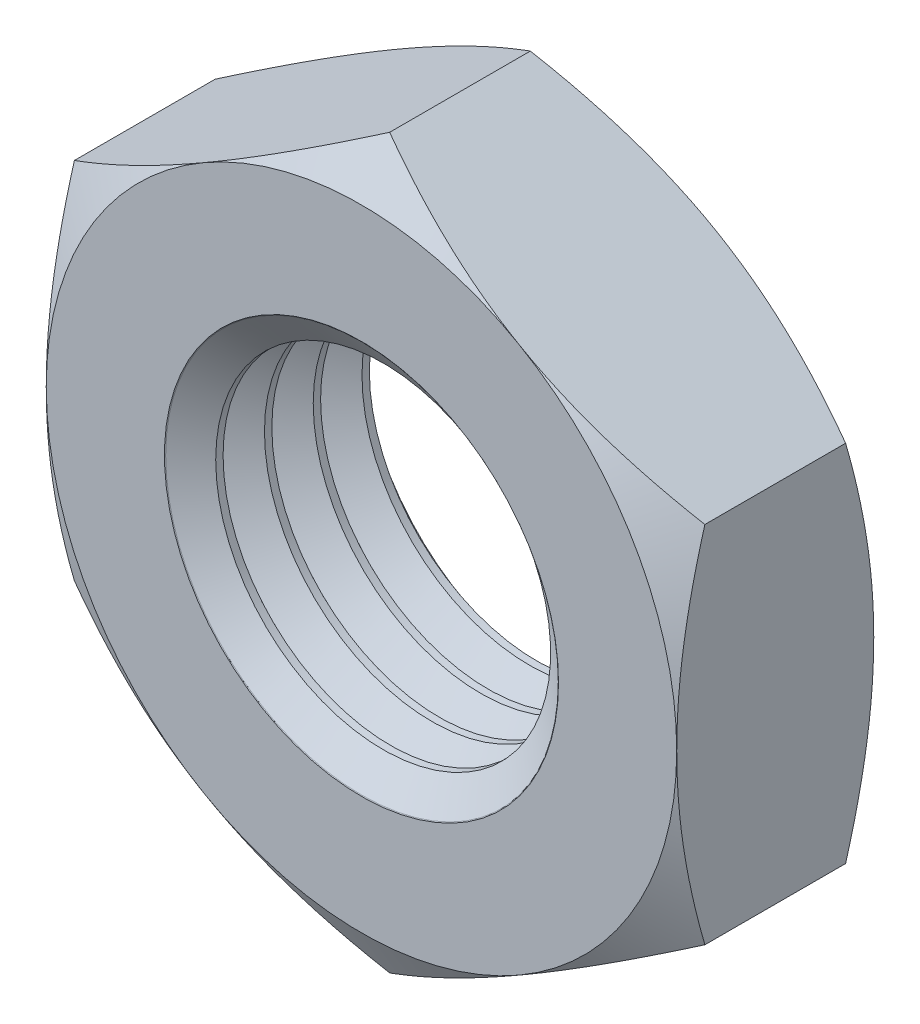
ISO-10303-21;
HEADER;
FILE_DESCRIPTION(('STEP AP214'),'2;1');
FILE_NAME('part.step','',(''),(''),'','','');
FILE_SCHEMA(('AUTOMOTIVE_DESIGN { 1 0 10303 214 1 1 1 1 }'));
ENDSEC;
DATA;
#1=APPLICATION_CONTEXT('core data for automotive mechanical design processes');
#2=APPLICATION_PROTOCOL_DEFINITION('international standard','automotive_design',2000,#1);
#3=PRODUCT_CONTEXT('',#1,'mechanical');
#4=PRODUCT('Part','Part','',(#3));
#5=PRODUCT_RELATED_PRODUCT_CATEGORY('part','',(#4));
#6=PRODUCT_DEFINITION_FORMATION('','',#4);
#7=PRODUCT_DEFINITION_CONTEXT('part definition',#1,'design');
#8=PRODUCT_DEFINITION('design','',#6,#7);
#9=PRODUCT_DEFINITION_SHAPE('','',#8);
#10=(LENGTH_UNIT() NAMED_UNIT(*) SI_UNIT(.MILLI.,.METRE.));
#11=(NAMED_UNIT(*) PLANE_ANGLE_UNIT() SI_UNIT($,.RADIAN.));
#12=(NAMED_UNIT(*) SI_UNIT($,.STERADIAN.) SOLID_ANGLE_UNIT());
#13=UNCERTAINTY_MEASURE_WITH_UNIT(LENGTH_MEASURE(1.E-05),#10,'distance_accuracy_value','');
#14=(GEOMETRIC_REPRESENTATION_CONTEXT(3) GLOBAL_UNCERTAINTY_ASSIGNED_CONTEXT((#13)) GLOBAL_UNIT_ASSIGNED_CONTEXT((#10,
#11,#12)) REPRESENTATION_CONTEXT('',''));
#15=CARTESIAN_POINT('',(0.,0.,0.));
#16=DIRECTION('',(0.,0.,1.));
#17=DIRECTION('',(1.,0.,0.));
#18=AXIS2_PLACEMENT_3D('',#15,#16,#17);
#19=CARTESIAN_POINT('',(0.,0.,-5.));
#20=DIRECTION('',(0.,0.,1.));
#21=DIRECTION('',(1.,0.,0.));
#22=AXIS2_PLACEMENT_3D('',#19,#20,#21);
#23=CYLINDRICAL_SURFACE('',#22,4.25);
#24=CARTESIAN_POINT('',(0.,0.,-4.26245565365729));
#25=DIRECTION('',(0.,0.,-1.));
#26=DIRECTION('',(-1.,0.,0.));
#27=AXIS2_PLACEMENT_3D('',#24,#25,#26);
#28=CIRCLE('',#27,4.25);
#29=CARTESIAN_POINT('',(-4.25,0.,-4.26245565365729));
#30=VERTEX_POINT('',#29);
#31=EDGE_CURVE('E344',#30,#30,#28,.T.);
#32=ORIENTED_EDGE('',*,*,#31,.F.);
#33=EDGE_LOOP('',(#32));
#34=FACE_BOUND('',#33,.T.);
#35=CARTESIAN_POINT('',(0.,0.,-4.44944434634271));
#36=DIRECTION('',(0.,0.,-1.));
#37=DIRECTION('',(-1.,0.,0.));
#38=AXIS2_PLACEMENT_3D('',#35,#36,#37);
#39=CIRCLE('',#38,4.25);
#40=CARTESIAN_POINT('',(-4.25,0.,-4.44944434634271));
#41=VERTEX_POINT('',#40);
#42=EDGE_CURVE('E174',#41,#41,#39,.F.);
#43=ORIENTED_EDGE('',*,*,#42,.F.);
#44=EDGE_LOOP('',(#43));
#45=FACE_BOUND('',#44,.T.);
#46=ADVANCED_FACE('F32',(#34,#45),#23,.F.);
#47=CARTESIAN_POINT('',(0.,0.,-3.21214434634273));
#48=DIRECTION('',(0.,0.,-1.));
#49=DIRECTION('',(-1.,0.,0.));
#50=AXIS2_PLACEMENT_3D('',#47,#48,#49);
#51=CIRCLE('',#50,4.25);
#52=CARTESIAN_POINT('',(-4.25,0.,-3.21214434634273));
#53=VERTEX_POINT('',#52);
#54=EDGE_CURVE('E347',#53,#53,#51,.T.);
#55=ORIENTED_EDGE('',*,*,#54,.T.);
#56=EDGE_LOOP('',(#55));
#57=FACE_BOUND('',#56,.T.);
#58=CARTESIAN_POINT('',(0.,0.,-3.02515565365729));
#59=DIRECTION('',(0.,0.,-1.));
#60=DIRECTION('',(-1.,0.,0.));
#61=AXIS2_PLACEMENT_3D('',#58,#59,#60);
#62=CIRCLE('',#61,4.25);
#63=CARTESIAN_POINT('',(-4.25,0.,-3.02515565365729));
#64=VERTEX_POINT('',#63);
#65=EDGE_CURVE('E335',#64,#64,#62,.T.);
#66=ORIENTED_EDGE('',*,*,#65,.F.);
#67=EDGE_LOOP('',(#66));
#68=FACE_BOUND('',#67,.T.);
#69=ADVANCED_FACE('F294',(#57,#68),#23,.F.);
#70=CARTESIAN_POINT('',(0.,0.,-1.97484434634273));
#71=DIRECTION('',(0.,0.,-1.));
#72=DIRECTION('',(-1.,0.,0.));
#73=AXIS2_PLACEMENT_3D('',#70,#71,#72);
#74=CIRCLE('',#73,4.25);
#75=CARTESIAN_POINT('',(-4.25,0.,-1.97484434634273));
#76=VERTEX_POINT('',#75);
#77=EDGE_CURVE('E338',#76,#76,#74,.T.);
#78=ORIENTED_EDGE('',*,*,#77,.T.);
#79=EDGE_LOOP('',(#78));
#80=FACE_BOUND('',#79,.T.);
#81=CARTESIAN_POINT('',(0.,0.,-1.78785565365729));
#82=DIRECTION('',(0.,0.,-1.));
#83=DIRECTION('',(-1.,0.,0.));
#84=AXIS2_PLACEMENT_3D('',#81,#82,#83);
#85=CIRCLE('',#84,4.25);
#86=CARTESIAN_POINT('',(-4.25,0.,-1.78785565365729));
#87=VERTEX_POINT('',#86);
#88=EDGE_CURVE('E326',#87,#87,#85,.T.);
#89=ORIENTED_EDGE('',*,*,#88,.F.);
#90=EDGE_LOOP('',(#89));
#91=FACE_BOUND('',#90,.T.);
#92=ADVANCED_FACE('F300',(#80,#91),#23,.F.);
#93=CARTESIAN_POINT('',(0.,0.,-0.737544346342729));
#94=DIRECTION('',(0.,0.,-1.));
#95=DIRECTION('',(-1.,0.,0.));
#96=AXIS2_PLACEMENT_3D('',#93,#94,#95);
#97=CIRCLE('',#96,4.25);
#98=CARTESIAN_POINT('',(-4.25,0.,-0.737544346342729));
#99=VERTEX_POINT('',#98);
#100=EDGE_CURVE('E316',#99,#99,#97,.T.);
#101=ORIENTED_EDGE('',*,*,#100,.T.);
#102=EDGE_LOOP('',(#101));
#103=FACE_BOUND('',#102,.T.);
#104=CARTESIAN_POINT('',(0.,0.,-0.550555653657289));
#105=DIRECTION('',(0.,0.,-1.));
#106=DIRECTION('',(-1.,0.,0.));
#107=AXIS2_PLACEMENT_3D('',#104,#105,#106);
#108=CIRCLE('',#107,4.25);
#109=CARTESIAN_POINT('',(-4.25,0.,-0.550555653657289));
#110=VERTEX_POINT('',#109);
#111=EDGE_CURVE('E319',#110,#110,#108,.T.);
#112=ORIENTED_EDGE('',*,*,#111,.F.);
#113=EDGE_LOOP('',(#112));
#114=FACE_BOUND('',#113,.T.);
#115=ADVANCED_FACE('F296',(#103,#114),#23,.F.);
#116=CARTESIAN_POINT('',(0.,9.23760430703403,-5.));
#117=DIRECTION('',(0.,0.,-1.));
#118=DIRECTION('',(-1.,0.,0.));
#119=AXIS2_PLACEMENT_3D('',#116,#117,#118);
#120=PLANE('',#119);
#121=CARTESIAN_POINT('',(0.,0.,-5.));
#122=DIRECTION('',(0.,0.,-1.));
#123=DIRECTION('',(-1.,0.,0.));
#124=AXIS2_PLACEMENT_3D('',#121,#122,#123);
#125=CIRCLE('',#124,8.);
#126=CARTESIAN_POINT('',(-8.,0.,-5.));
#127=VERTEX_POINT('',#126);
#128=CARTESIAN_POINT('',(-4.00000000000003,-6.92820323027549,-5.));
#129=VERTEX_POINT('',#128);
#130=EDGE_CURVE('E168',#127,#129,#125,.F.);
#131=ORIENTED_EDGE('',*,*,#130,.F.);
#132=CARTESIAN_POINT('',(-4.00000000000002,6.9282032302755,-5.));
#133=VERTEX_POINT('',#132);
#134=EDGE_CURVE('E150',#133,#127,#125,.F.);
#135=ORIENTED_EDGE('',*,*,#134,.F.);
#136=CARTESIAN_POINT('',(4.00000000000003,6.92820323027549,-5.));
#137=VERTEX_POINT('',#136);
#138=EDGE_CURVE('E167',#137,#133,#125,.F.);
#139=ORIENTED_EDGE('',*,*,#138,.F.);
#140=CARTESIAN_POINT('',(0.,0.,-5.));
#141=DIRECTION('',(0.,0.,1.));
#142=DIRECTION('',(1.,0.,0.));
#143=AXIS2_PLACEMENT_3D('',#140,#141,#142);
#144=CIRCLE('',#143,8.);
#145=CARTESIAN_POINT('',(8.,0.,-5.));
#146=VERTEX_POINT('',#145);
#147=EDGE_CURVE('E241',#146,#137,#144,.T.);
#148=ORIENTED_EDGE('',*,*,#147,.F.);
#149=CARTESIAN_POINT('',(4.00000000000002,-6.9282032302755,-5.));
#150=VERTEX_POINT('',#149);
#151=EDGE_CURVE('E465',#150,#146,#125,.F.);
#152=ORIENTED_EDGE('',*,*,#151,.F.);
#153=EDGE_CURVE('E486',#129,#150,#125,.F.);
#154=ORIENTED_EDGE('',*,*,#153,.F.);
#155=EDGE_LOOP('',(#131,#135,#139,#148,#152,#154));
#156=FACE_BOUND('',#155,.T.);
#157=CARTESIAN_POINT('',(0.,0.,-5.));
#158=DIRECTION('',(0.,0.,-1.));
#159=DIRECTION('',(-1.,0.,0.));
#160=AXIS2_PLACEMENT_3D('',#157,#158,#159);
#161=CIRCLE('',#160,5.);
#162=CARTESIAN_POINT('',(-5.,0.,-5.));
#163=VERTEX_POINT('',#162);
#164=EDGE_CURVE('E172',#163,#163,#161,.F.);
#165=ORIENTED_EDGE('',*,*,#164,.T.);
#166=EDGE_LOOP('',(#165));
#167=FACE_BOUND('',#166,.T.);
#168=ADVANCED_FACE('F305',(#156,#167),#120,.T.);
#169=CARTESIAN_POINT('',(0.,9.23760430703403,0.));
#170=DIRECTION('',(0.,0.,-1.));
#171=DIRECTION('',(-1.,0.,0.));
#172=AXIS2_PLACEMENT_3D('',#169,#170,#171);
#173=PLANE('',#172);
#174=CARTESIAN_POINT('',(0.,0.,0.));
#175=DIRECTION('',(0.,0.,-1.));
#176=DIRECTION('',(-1.,0.,0.));
#177=AXIS2_PLACEMENT_3D('',#174,#175,#176);
#178=CIRCLE('',#177,8.);
#179=CARTESIAN_POINT('',(-8.,0.,0.));
#180=VERTEX_POINT('',#179);
#181=CARTESIAN_POINT('',(-4.00000000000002,6.9282032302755,0.));
#182=VERTEX_POINT('',#181);
#183=EDGE_CURVE('E11',#180,#182,#178,.T.);
#184=ORIENTED_EDGE('',*,*,#183,.F.);
#185=CARTESIAN_POINT('',(-4.00000000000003,-6.92820323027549,0.));
#186=VERTEX_POINT('',#185);
#187=EDGE_CURVE('E44',#186,#180,#178,.T.);
#188=ORIENTED_EDGE('',*,*,#187,.F.);
#189=CARTESIAN_POINT('',(4.00000000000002,-6.9282032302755,0.));
#190=VERTEX_POINT('',#189);
#191=EDGE_CURVE('E171',#190,#186,#178,.T.);
#192=ORIENTED_EDGE('',*,*,#191,.F.);
#193=CARTESIAN_POINT('',(8.,0.,0.));
#194=VERTEX_POINT('',#193);
#195=EDGE_CURVE('E423',#194,#190,#178,.T.);
#196=ORIENTED_EDGE('',*,*,#195,.F.);
#197=CARTESIAN_POINT('',(0.,0.,0.));
#198=DIRECTION('',(0.,0.,1.));
#199=DIRECTION('',(1.,0.,0.));
#200=AXIS2_PLACEMENT_3D('',#197,#198,#199);
#201=CIRCLE('',#200,8.);
#202=CARTESIAN_POINT('',(4.00000000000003,6.92820323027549,0.));
#203=VERTEX_POINT('',#202);
#204=EDGE_CURVE('E126',#194,#203,#201,.T.);
#205=ORIENTED_EDGE('',*,*,#204,.T.);
#206=EDGE_CURVE('E42',#182,#203,#178,.T.);
#207=ORIENTED_EDGE('',*,*,#206,.F.);
#208=EDGE_LOOP('',(#184,#188,#192,#196,#205,#207));
#209=FACE_BOUND('',#208,.T.);
#210=CARTESIAN_POINT('',(0.,0.,0.));
#211=DIRECTION('',(0.,0.,1.));
#212=DIRECTION('',(1.,0.,0.));
#213=AXIS2_PLACEMENT_3D('',#210,#211,#212);
#214=CIRCLE('',#213,5.);
#215=CARTESIAN_POINT('',(5.,0.,0.));
#216=VERTEX_POINT('',#215);
#217=EDGE_CURVE('E177',#216,#216,#214,.T.);
#218=ORIENTED_EDGE('',*,*,#217,.F.);
#219=EDGE_LOOP('',(#218));
#220=FACE_BOUND('',#219,.T.);
#221=ADVANCED_FACE('F246',(#209,#220),#173,.F.);
#222=CARTESIAN_POINT('',(0.,9.23760430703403,-5.));
#223=DIRECTION('',(-0.500000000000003,0.866025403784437,0.));
#224=DIRECTION('',(-0.866025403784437,-0.500000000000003,0.));
#225=AXIS2_PLACEMENT_3D('',#222,#223,#224);
#226=PLANE('',#225);
#227=DIRECTION('',(0.,0.,1.));
#228=VECTOR('',#227,1.);
#229=CARTESIAN_POINT('',(-8.,4.61880215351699,-5.));
#230=LINE('',#229,#228);
#231=CARTESIAN_POINT('',(-8.,4.61880215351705,-4.28546882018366));
#232=VERTEX_POINT('',#231);
#233=CARTESIAN_POINT('',(-8.,4.61880215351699,-0.714531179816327));
#234=VERTEX_POINT('',#233);
#235=EDGE_CURVE('E162',#232,#234,#230,.T.);
#236=ORIENTED_EDGE('',*,*,#235,.T.);
#237=CARTESIAN_POINT('',(-8.0002,4.61868668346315,-0.714597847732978));
#238=CARTESIAN_POINT('',(-7.8243512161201,4.72021302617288,-0.655990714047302));
#239=CARTESIAN_POINT('',(-7.64784680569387,4.82211789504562,-0.600043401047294));
#240=CARTESIAN_POINT('',(-7.29340453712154,5.02675523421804,-0.494201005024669));
#241=CARTESIAN_POINT('',(-7.11546609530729,5.12948804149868,-0.444308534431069));
#242=CARTESIAN_POINT('',(-6.57880176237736,5.43933133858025,-0.304692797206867));
#243=CARTESIAN_POINT('',(-6.21795741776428,5.64766491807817,-0.225281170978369));
#244=CARTESIAN_POINT('',(-5.67796082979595,5.95943209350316,-0.132161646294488));
#245=CARTESIAN_POINT('',(-5.50042181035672,6.06193429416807,-0.105634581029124));
#246=CARTESIAN_POINT('',(-5.1445408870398,6.26740224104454,-0.0611531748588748));
#247=CARTESIAN_POINT('',(-4.96619905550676,6.37036794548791,-0.043198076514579));
#248=CARTESIAN_POINT('',(-4.60920831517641,6.57647664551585,-0.0163156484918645));
#249=CARTESIAN_POINT('',(-4.4305599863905,6.67961930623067,-0.00737807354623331));
#250=CARTESIAN_POINT('',(-4.07309829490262,6.88599991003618,0.0012776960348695));
#251=CARTESIAN_POINT('',(-3.89428493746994,6.98923785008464,0.000996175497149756));
#252=CARTESIAN_POINT('',(-3.5599866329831,7.18224506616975,-0.00814502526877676));
#253=CARTESIAN_POINT('',(-3.40447809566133,7.27202796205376,-0.0158896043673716));
#254=CARTESIAN_POINT('',(-3.09382523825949,7.45138347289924,-0.0382011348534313));
#255=CARTESIAN_POINT('',(-2.93868094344,7.54095607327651,-0.0527685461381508));
#256=CARTESIAN_POINT('',(-2.47384868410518,7.80932710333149,-0.10636069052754));
#257=CARTESIAN_POINT('',(-2.16498351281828,7.98765049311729,-0.15526864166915));
#258=CARTESIAN_POINT('',(-1.5439767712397,8.34618890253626,-0.277539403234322));
#259=CARTESIAN_POINT('',(-1.23191445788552,8.52635816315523,-0.351420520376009));
#260=CARTESIAN_POINT('',(-0.612443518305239,8.88400987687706,-0.519100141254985));
#261=CARTESIAN_POINT('',(-0.305026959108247,9.06149691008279,-0.612859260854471));
#262=CARTESIAN_POINT('',(0.000200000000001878,9.23771977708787,-0.714597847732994));
#263=B_SPLINE_CURVE_WITH_KNOTS('',3,(#237,#238,#239,#240,#241,#242,#243,#244,#245,#246,#247,
#248,#249,#250,#251,#252,#253,#254,#255,#256,#257,#258,#259,#260,#261,#262),.UNSPECIFIED.,.F.,
.F.,(4,2,2,2,2,2,2,2,2,2,2,2,4),(0.,0.633973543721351,1.26821965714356,2.53934712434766,
3.15934343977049,3.77928496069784,4.39852133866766,5.01773858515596,5.55680239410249,
6.09590254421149,7.17487077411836,8.27776850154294,9.37850115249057),.UNSPECIFIED.);
#264=EDGE_CURVE('E131',#234,#182,#263,.T.);
#265=ORIENTED_EDGE('',*,*,#264,.T.);
#266=CARTESIAN_POINT('',(0.,9.23760430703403,-0.714531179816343));
#267=VERTEX_POINT('',#266);
#268=EDGE_CURVE('E51',#182,#267,#263,.T.);
#269=ORIENTED_EDGE('',*,*,#268,.T.);
#270=DIRECTION('',(0.,0.,1.));
#271=VECTOR('',#270,1.);
#272=CARTESIAN_POINT('',(0.,9.23760430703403,-5.));
#273=LINE('',#272,#271);
#274=CARTESIAN_POINT('',(0.,9.23760430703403,-4.28546882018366));
#275=VERTEX_POINT('',#274);
#276=EDGE_CURVE('E147',#275,#267,#273,.T.);
#277=ORIENTED_EDGE('',*,*,#276,.F.);
#278=CARTESIAN_POINT('',(-8.0002,4.61868668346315,-4.28540215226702));
#279=CARTESIAN_POINT('',(-7.8243512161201,4.72021302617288,-4.3440092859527));
#280=CARTESIAN_POINT('',(-7.64784680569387,4.82211789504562,-4.39995659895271));
#281=CARTESIAN_POINT('',(-7.29340453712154,5.02675523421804,-4.50579899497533));
#282=CARTESIAN_POINT('',(-7.11546609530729,5.12948804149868,-4.55569146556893));
#283=CARTESIAN_POINT('',(-6.57880176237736,5.43933133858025,-4.69530720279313));
#284=CARTESIAN_POINT('',(-6.21795741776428,5.64766491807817,-4.77471882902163));
#285=CARTESIAN_POINT('',(-5.67796082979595,5.95943209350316,-4.86783835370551));
#286=CARTESIAN_POINT('',(-5.50042181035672,6.06193429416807,-4.89436541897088));
#287=CARTESIAN_POINT('',(-5.1445408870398,6.26740224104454,-4.93884682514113));
#288=CARTESIAN_POINT('',(-4.96619905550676,6.37036794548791,-4.95680192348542));
#289=CARTESIAN_POINT('',(-4.60920831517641,6.57647664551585,-4.98368435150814));
#290=CARTESIAN_POINT('',(-4.4305599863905,6.67961930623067,-4.99262192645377));
#291=CARTESIAN_POINT('',(-4.07309829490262,6.88599991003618,-5.00127769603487));
#292=CARTESIAN_POINT('',(-3.89428493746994,6.98923785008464,-5.00099617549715));
#293=CARTESIAN_POINT('',(-3.5599866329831,7.18224506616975,-4.99185497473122));
#294=CARTESIAN_POINT('',(-3.40447809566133,7.27202796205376,-4.98411039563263));
#295=CARTESIAN_POINT('',(-3.09382523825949,7.45138347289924,-4.96179886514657));
#296=CARTESIAN_POINT('',(-2.93868094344,7.54095607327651,-4.94723145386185));
#297=CARTESIAN_POINT('',(-2.47384868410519,7.80932710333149,-4.89363930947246));
#298=CARTESIAN_POINT('',(-2.16498351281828,7.98765049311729,-4.84473135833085));
#299=CARTESIAN_POINT('',(-1.5439767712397,8.34618890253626,-4.72246059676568));
#300=CARTESIAN_POINT('',(-1.23191445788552,8.52635816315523,-4.64857947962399));
#301=CARTESIAN_POINT('',(-0.61244351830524,8.88400987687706,-4.48089985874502));
#302=CARTESIAN_POINT('',(-0.305026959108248,9.06149691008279,-4.38714073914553));
#303=CARTESIAN_POINT('',(0.000200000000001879,9.23771977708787,-4.28540215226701));
#304=B_SPLINE_CURVE_WITH_KNOTS('',3,(#278,#279,#280,#281,#282,#283,#284,#285,#286,#287,#288,
#289,#290,#291,#292,#293,#294,#295,#296,#297,#298,#299,#300,#301,#302,#303),.UNSPECIFIED.,.F.,
.F.,(4,2,2,2,2,2,2,2,2,2,2,2,4),(0.,0.63397354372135,1.26821965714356,2.53934712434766,
3.15934343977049,3.77928496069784,4.39852133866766,5.01773858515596,5.55680239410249,
6.09590254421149,7.17487077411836,8.27776850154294,9.37850115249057),.UNSPECIFIED.);
#305=EDGE_CURVE('E165',#133,#275,#304,.T.);
#306=ORIENTED_EDGE('',*,*,#305,.F.);
#307=EDGE_CURVE('E256',#232,#133,#304,.T.);
#308=ORIENTED_EDGE('',*,*,#307,.F.);
#309=EDGE_LOOP('',(#236,#265,#269,#277,#306,#308));
#310=FACE_BOUND('',#309,.T.);
#311=ADVANCED_FACE('F34',(#310),#226,.T.);
#312=CARTESIAN_POINT('',(8.,4.61880215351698,-5.));
#313=DIRECTION('',(0.500000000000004,0.866025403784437,0.));
#314=DIRECTION('',(-0.866025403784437,0.500000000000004,0.));
#315=AXIS2_PLACEMENT_3D('',#312,#313,#314);
#316=PLANE('',#315);
#317=ORIENTED_EDGE('',*,*,#276,.T.);
#318=CARTESIAN_POINT('',(-0.000199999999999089,9.23771977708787,-0.714597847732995));
#319=CARTESIAN_POINT('',(0.175648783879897,9.13619343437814,-0.655990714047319));
#320=CARTESIAN_POINT('',(0.352153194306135,9.0342885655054,-0.60004340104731));
#321=CARTESIAN_POINT('',(0.706595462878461,8.82965122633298,-0.494201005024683));
#322=CARTESIAN_POINT('',(0.884533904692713,8.72691841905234,-0.444308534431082));
#323=CARTESIAN_POINT('',(1.42119823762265,8.41707512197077,-0.304692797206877));
#324=CARTESIAN_POINT('',(1.78204258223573,8.20874154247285,-0.225281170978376));
#325=CARTESIAN_POINT('',(2.32203917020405,7.89697436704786,-0.132161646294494));
#326=CARTESIAN_POINT('',(2.49957818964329,7.79447216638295,-0.10563458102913));
#327=CARTESIAN_POINT('',(2.8554591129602,7.58900421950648,-0.0611531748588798));
#328=CARTESIAN_POINT('',(3.03380094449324,7.4860385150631,-0.043198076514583));
#329=CARTESIAN_POINT('',(3.3907916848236,7.27992981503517,-0.0163156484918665));
#330=CARTESIAN_POINT('',(3.56944001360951,7.17678715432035,-0.0073780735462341));
#331=CARTESIAN_POINT('',(3.92690170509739,6.97040655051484,0.0012776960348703));
#332=CARTESIAN_POINT('',(4.10571506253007,6.86716861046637,0.000996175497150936));
#333=CARTESIAN_POINT('',(4.44001336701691,6.67416139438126,-0.00814502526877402));
#334=CARTESIAN_POINT('',(4.59552190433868,6.58437849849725,-0.0158896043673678));
#335=CARTESIAN_POINT('',(4.90617476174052,6.40502298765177,-0.0382011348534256));
#336=CARTESIAN_POINT('',(5.06131905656,6.31545038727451,-0.0527685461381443));
#337=CARTESIAN_POINT('',(5.52615131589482,6.04707935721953,-0.106360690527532));
#338=CARTESIAN_POINT('',(5.83501648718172,5.86875596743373,-0.15526864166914));
#339=CARTESIAN_POINT('',(6.4560232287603,5.51021755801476,-0.277539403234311));
#340=CARTESIAN_POINT('',(6.76808554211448,5.33004829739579,-0.351420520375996));
#341=CARTESIAN_POINT('',(7.38755648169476,4.97239658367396,-0.51910014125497));
#342=CARTESIAN_POINT('',(7.69497304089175,4.79490955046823,-0.612859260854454));
#343=CARTESIAN_POINT('',(8.0002,4.61868668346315,-0.714597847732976));
#344=B_SPLINE_CURVE_WITH_KNOTS('',3,(#318,#319,#320,#321,#322,#323,#324,#325,#326,#327,#328,
#329,#330,#331,#332,#333,#334,#335,#336,#337,#338,#339,#340,#341,#342,#343),.UNSPECIFIED.,.F.,
.F.,(4,2,2,2,2,2,2,2,2,2,2,2,4),(0.,0.633973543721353,1.26821965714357,2.53934712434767,
3.1593434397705,3.77928496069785,4.39852133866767,5.01773858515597,5.55680239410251,
6.0959025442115,7.17487077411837,8.27776850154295,9.37850115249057),.UNSPECIFIED.);
#345=EDGE_CURVE('E141',#267,#203,#344,.T.);
#346=ORIENTED_EDGE('',*,*,#345,.T.);
#347=CARTESIAN_POINT('',(8.,4.61880215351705,-0.714531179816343));
#348=VERTEX_POINT('',#347);
#349=EDGE_CURVE('E58',#203,#348,#344,.T.);
#350=ORIENTED_EDGE('',*,*,#349,.T.);
#351=DIRECTION('',(0.,0.,1.));
#352=VECTOR('',#351,1.);
#353=CARTESIAN_POINT('',(8.,4.61880215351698,-5.));
#354=LINE('',#353,#352);
#355=CARTESIAN_POINT('',(8.,4.61880215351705,-4.28546882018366));
#356=VERTEX_POINT('',#355);
#357=EDGE_CURVE('E140',#356,#348,#354,.T.);
#358=ORIENTED_EDGE('',*,*,#357,.F.);
#359=CARTESIAN_POINT('',(-0.000199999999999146,9.23771977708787,-4.28540215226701));
#360=CARTESIAN_POINT('',(0.175648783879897,9.13619343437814,-4.34400928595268));
#361=CARTESIAN_POINT('',(0.352153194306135,9.0342885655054,-4.39995659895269));
#362=CARTESIAN_POINT('',(0.70659546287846,8.82965122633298,-4.50579899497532));
#363=CARTESIAN_POINT('',(0.884533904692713,8.72691841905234,-4.55569146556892));
#364=CARTESIAN_POINT('',(1.42119823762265,8.41707512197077,-4.69530720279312));
#365=CARTESIAN_POINT('',(1.78204258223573,8.20874154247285,-4.77471882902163));
#366=CARTESIAN_POINT('',(2.32203917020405,7.89697436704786,-4.86783835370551));
#367=CARTESIAN_POINT('',(2.49957818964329,7.79447216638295,-4.89436541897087));
#368=CARTESIAN_POINT('',(2.8554591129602,7.58900421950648,-4.93884682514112));
#369=CARTESIAN_POINT('',(3.03380094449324,7.4860385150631,-4.95680192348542));
#370=CARTESIAN_POINT('',(3.3907916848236,7.27992981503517,-4.98368435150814));
#371=CARTESIAN_POINT('',(3.56944001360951,7.17678715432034,-4.99262192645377));
#372=CARTESIAN_POINT('',(3.92690170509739,6.97040655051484,-5.00127769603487));
#373=CARTESIAN_POINT('',(4.10571506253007,6.86716861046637,-5.00099617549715));
#374=CARTESIAN_POINT('',(4.44001336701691,6.67416139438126,-4.99185497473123));
#375=CARTESIAN_POINT('',(4.59552190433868,6.58437849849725,-4.98411039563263));
#376=CARTESIAN_POINT('',(4.90617476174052,6.40502298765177,-4.96179886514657));
#377=CARTESIAN_POINT('',(5.06131905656,6.31545038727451,-4.94723145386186));
#378=CARTESIAN_POINT('',(5.52615131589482,6.04707935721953,-4.89363930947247));
#379=CARTESIAN_POINT('',(5.83501648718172,5.86875596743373,-4.84473135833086));
#380=CARTESIAN_POINT('',(6.4560232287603,5.51021755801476,-4.72246059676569));
#381=CARTESIAN_POINT('',(6.76808554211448,5.33004829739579,-4.648579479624));
#382=CARTESIAN_POINT('',(7.38755648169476,4.97239658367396,-4.48089985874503));
#383=CARTESIAN_POINT('',(7.69497304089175,4.79490955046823,-4.38714073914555));
#384=CARTESIAN_POINT('',(8.0002,4.61868668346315,-4.28540215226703));
#385=B_SPLINE_CURVE_WITH_KNOTS('',3,(#359,#360,#361,#362,#363,#364,#365,#366,#367,#368,#369,
#370,#371,#372,#373,#374,#375,#376,#377,#378,#379,#380,#381,#382,#383,#384),.UNSPECIFIED.,.F.,
.F.,(4,2,2,2,2,2,2,2,2,2,2,2,4),(0.,0.633973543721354,1.26821965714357,2.53934712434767,
3.1593434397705,3.77928496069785,4.39852133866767,5.01773858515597,5.55680239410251,
6.0959025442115,7.17487077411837,8.27776850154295,9.37850115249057),.UNSPECIFIED.);
#386=EDGE_CURVE('E250',#137,#356,#385,.T.);
#387=ORIENTED_EDGE('',*,*,#386,.F.);
#388=EDGE_CURVE('E255',#275,#137,#385,.T.);
#389=ORIENTED_EDGE('',*,*,#388,.F.);
#390=EDGE_LOOP('',(#317,#346,#350,#358,#387,#389));
#391=FACE_BOUND('',#390,.T.);
#392=ADVANCED_FACE('F138',(#391),#316,.T.);
#393=CARTESIAN_POINT('',(8.,4.61880215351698,-5.));
#394=DIRECTION('',(-1.,0.,0.));
#395=DIRECTION('',(0.,0.,1.));
#396=AXIS2_PLACEMENT_3D('',#393,#394,#395);
#397=PLANE('',#396);
#398=CARTESIAN_POINT('',(8.,-12.2497439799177,-3.82821364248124));
#399=CARTESIAN_POINT('',(8.,-11.8984987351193,-3.65847254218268));
#400=CARTESIAN_POINT('',(8.,-11.5464230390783,-3.49041880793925));
#401=CARTESIAN_POINT('',(8.,-10.8401616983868,-3.15865029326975));
#402=CARTESIAN_POINT('',(8.,-10.4859757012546,-2.99493626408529));
#403=CARTESIAN_POINT('',(8.,-9.77313142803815,-2.67194892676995));
#404=CARTESIAN_POINT('',(8.,-9.41445915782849,-2.5127063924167));
#405=CARTESIAN_POINT('',(8.,-8.69416671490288,-2.20106116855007));
#406=CARTESIAN_POINT('',(8.,-8.3325466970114,-2.048658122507));
#407=CARTESIAN_POINT('',(8.,-7.60129405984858,-1.7507013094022));
#408=CARTESIAN_POINT('',(8.,-7.23161757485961,-1.60525460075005));
#409=CARTESIAN_POINT('',(8.,-6.4879052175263,-1.32575242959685));
#410=CARTESIAN_POINT('',(8.,-6.11386886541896,-1.19169823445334));
#411=CARTESIAN_POINT('',(8.,-5.36160531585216,-0.938583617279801));
#412=CARTESIAN_POINT('',(8.,-4.98338896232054,-0.819491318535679));
#413=CARTESIAN_POINT('',(8.,-4.22159300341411,-0.600166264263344));
#414=CARTESIAN_POINT('',(8.,-3.83801513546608,-0.499927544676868));
#415=CARTESIAN_POINT('',(8.,-3.0651700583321,-0.323183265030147));
#416=CARTESIAN_POINT('',(8.,-2.67590136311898,-0.246684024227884));
#417=CARTESIAN_POINT('',(8.,-2.08857290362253,-0.153570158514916));
#418=CARTESIAN_POINT('',(8.,-1.8922017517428,-0.126136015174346));
#419=CARTESIAN_POINT('',(8.,-1.49853877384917,-0.0790191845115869));
#420=CARTESIAN_POINT('',(8.,-1.30124704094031,-0.0593357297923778));
#421=CARTESIAN_POINT('',(8.,-0.907261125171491,-0.0282499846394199));
#422=CARTESIAN_POINT('',(8.,-0.710571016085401,-0.016796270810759));
#423=CARTESIAN_POINT('',(8.,-0.316882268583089,-0.00223056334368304));
#424=CARTESIAN_POINT('',(8.,-0.119883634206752,0.000881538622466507));
#425=CARTESIAN_POINT('',(8.,0.274012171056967,-0.00131013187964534));
#426=CARTESIAN_POINT('',(8.,0.470909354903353,-0.00661154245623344));
#427=CARTESIAN_POINT('',(8.,0.864308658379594,-0.0254984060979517));
#428=CARTESIAN_POINT('',(8.,1.06081075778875,-0.0390842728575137));
#429=CARTESIAN_POINT('',(8.,1.53707134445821,-0.0817685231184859));
#430=CARTESIAN_POINT('',(8.,1.81646391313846,-0.115017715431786));
#431=CARTESIAN_POINT('',(8.,2.37310809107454,-0.196418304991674));
#432=CARTESIAN_POINT('',(8.,2.65035909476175,-0.244573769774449));
#433=CARTESIAN_POINT('',(8.,3.20249141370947,-0.354078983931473));
#434=CARTESIAN_POINT('',(8.,3.47737023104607,-0.415441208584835));
#435=CARTESIAN_POINT('',(8.,4.02429975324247,-0.549487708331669));
#436=CARTESIAN_POINT('',(8.,4.29635072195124,-0.62217091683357));
#437=CARTESIAN_POINT('',(8.,4.84432510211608,-0.779020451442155));
#438=CARTESIAN_POINT('',(8.,5.12017997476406,-0.863424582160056));
#439=CARTESIAN_POINT('',(8.,5.66897392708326,-1.04057245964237));
#440=CARTESIAN_POINT('',(8.,5.94191487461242,-1.13331045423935));
#441=CARTESIAN_POINT('',(8.,6.48378576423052,-1.32521046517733));
#442=CARTESIAN_POINT('',(8.,6.75272963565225,-1.42433338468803));
#443=CARTESIAN_POINT('',(8.,7.28853074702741,-1.62839717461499));
#444=CARTESIAN_POINT('',(8.,7.55538709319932,-1.7333403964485));
#445=CARTESIAN_POINT('',(8.,7.82127397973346,-1.8406180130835));
#446=B_SPLINE_CURVE_WITH_KNOTS('',3,(#398,#399,#400,#401,#402,#403,#404,#405,#406,#407,#408,
#409,#410,#411,#412,#413,#414,#415,#416,#417,#418,#419,#420,#421,#422,#423,#424,#425,#426,#427,
#428,#429,#430,#431,#432,#433,#434,#435,#436,#437,#438,#439,#440,#441,#442,#443,#444,#445),
.UNSPECIFIED.,.F.,.F.,(4,2,2,2,2,2,2,2,2,2,2,2,2,2,2,2,2,2,2,2,2,2,2,4),(0.,1.17034358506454,
2.3408884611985,3.51813189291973,4.69531388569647,5.88694801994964,7.07871454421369,
8.26789729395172,9.45670322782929,10.6458253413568,11.2405311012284,11.8351779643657,
12.4260760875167,13.0169665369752,13.6076911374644,14.1984452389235,15.0420672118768,
15.8859195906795,16.7305726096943,17.5751460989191,18.4404219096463,19.3051050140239,
20.1649211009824,21.0250871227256),.UNSPECIFIED.);
#447=CARTESIAN_POINT('',(8.,-4.61880215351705,-0.714531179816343));
#448=VERTEX_POINT('',#447);
#449=EDGE_CURVE('E133',#448,#194,#446,.T.);
#450=ORIENTED_EDGE('',*,*,#449,.F.);
#451=DIRECTION('',(0.,0.,1.));
#452=VECTOR('',#451,1.);
#453=CARTESIAN_POINT('',(8.,-4.61880215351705,-5.));
#454=LINE('',#453,#452);
#455=CARTESIAN_POINT('',(8.,-4.61880215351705,-4.28546882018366));
#456=VERTEX_POINT('',#455);
#457=EDGE_CURVE('E148',#456,#448,#454,.T.);
#458=ORIENTED_EDGE('',*,*,#457,.F.);
#459=CARTESIAN_POINT('',(8.,-12.2497439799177,-1.17178635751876));
#460=CARTESIAN_POINT('',(8.,-11.8984987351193,-1.34152745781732));
#461=CARTESIAN_POINT('',(8.,-11.5464230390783,-1.50958119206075));
#462=CARTESIAN_POINT('',(8.,-10.8401616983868,-1.84134970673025));
#463=CARTESIAN_POINT('',(8.,-10.4859757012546,-2.00506373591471));
#464=CARTESIAN_POINT('',(8.,-9.77313142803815,-2.32805107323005));
#465=CARTESIAN_POINT('',(8.,-9.41445915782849,-2.4872936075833));
#466=CARTESIAN_POINT('',(8.,-8.69416671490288,-2.79893883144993));
#467=CARTESIAN_POINT('',(8.,-8.3325466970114,-2.951341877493));
#468=CARTESIAN_POINT('',(8.,-7.60129405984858,-3.2492986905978));
#469=CARTESIAN_POINT('',(8.,-7.23161757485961,-3.39474539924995));
#470=CARTESIAN_POINT('',(8.,-6.4879052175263,-3.67424757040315));
#471=CARTESIAN_POINT('',(8.,-6.11386886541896,-3.80830176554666));
#472=CARTESIAN_POINT('',(8.,-5.36160531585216,-4.0614163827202));
#473=CARTESIAN_POINT('',(8.,-4.98338896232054,-4.18050868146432));
#474=CARTESIAN_POINT('',(8.,-4.22159300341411,-4.39983373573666));
#475=CARTESIAN_POINT('',(8.,-3.83801513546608,-4.50007245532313));
#476=CARTESIAN_POINT('',(8.,-3.0651700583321,-4.67681673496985));
#477=CARTESIAN_POINT('',(8.,-2.67590136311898,-4.75331597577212));
#478=CARTESIAN_POINT('',(8.,-2.08857290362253,-4.84642984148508));
#479=CARTESIAN_POINT('',(8.,-1.8922017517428,-4.87386398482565));
#480=CARTESIAN_POINT('',(8.,-1.49853877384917,-4.92098081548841));
#481=CARTESIAN_POINT('',(8.,-1.30124704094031,-4.94066427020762));
#482=CARTESIAN_POINT('',(8.,-0.907261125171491,-4.97175001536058));
#483=CARTESIAN_POINT('',(8.,-0.710571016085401,-4.98320372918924));
#484=CARTESIAN_POINT('',(8.,-0.316882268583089,-4.99776943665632));
#485=CARTESIAN_POINT('',(8.,-0.119883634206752,-5.00088153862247));
#486=CARTESIAN_POINT('',(8.,0.274012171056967,-4.99868986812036));
#487=CARTESIAN_POINT('',(8.,0.470909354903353,-4.99338845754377));
#488=CARTESIAN_POINT('',(8.,0.864308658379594,-4.97450159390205));
#489=CARTESIAN_POINT('',(8.,1.06081075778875,-4.96091572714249));
#490=CARTESIAN_POINT('',(8.,1.53707134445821,-4.91823147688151));
#491=CARTESIAN_POINT('',(8.,1.81646391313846,-4.88498228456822));
#492=CARTESIAN_POINT('',(8.,2.37310809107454,-4.80358169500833));
#493=CARTESIAN_POINT('',(8.,2.65035909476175,-4.75542623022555));
#494=CARTESIAN_POINT('',(8.,3.20249141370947,-4.64592101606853));
#495=CARTESIAN_POINT('',(8.,3.47737023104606,-4.58455879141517));
#496=CARTESIAN_POINT('',(8.,4.02429975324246,-4.45051229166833));
#497=CARTESIAN_POINT('',(8.,4.29635072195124,-4.37782908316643));
#498=CARTESIAN_POINT('',(8.,4.84432510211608,-4.22097954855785));
#499=CARTESIAN_POINT('',(8.,5.12017997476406,-4.13657541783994));
#500=CARTESIAN_POINT('',(8.,5.66897392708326,-3.95942754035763));
#501=CARTESIAN_POINT('',(8.,5.94191487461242,-3.86668954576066));
#502=CARTESIAN_POINT('',(8.,6.48378576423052,-3.67478953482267));
#503=CARTESIAN_POINT('',(8.,6.75272963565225,-3.57566661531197));
#504=CARTESIAN_POINT('',(8.,7.28853074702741,-3.37160282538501));
#505=CARTESIAN_POINT('',(8.,7.55538709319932,-3.2666596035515));
#506=CARTESIAN_POINT('',(8.,7.82127397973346,-3.1593819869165));
#507=B_SPLINE_CURVE_WITH_KNOTS('',3,(#459,#460,#461,#462,#463,#464,#465,#466,#467,#468,#469,
#470,#471,#472,#473,#474,#475,#476,#477,#478,#479,#480,#481,#482,#483,#484,#485,#486,#487,#488,
#489,#490,#491,#492,#493,#494,#495,#496,#497,#498,#499,#500,#501,#502,#503,#504,#505,#506),
.UNSPECIFIED.,.F.,.F.,(4,2,2,2,2,2,2,2,2,2,2,2,2,2,2,2,2,2,2,2,2,2,2,4),(0.,1.17034358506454,
2.3408884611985,3.51813189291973,4.69531388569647,5.88694801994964,7.07871454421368,
8.26789729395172,9.45670322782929,10.6458253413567,11.2405311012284,11.8351779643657,
12.4260760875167,13.0169665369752,13.6076911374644,14.1984452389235,15.0420672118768,
15.8859195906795,16.7305726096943,17.5751460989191,18.4404219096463,19.3051050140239,
20.1649211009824,21.0250871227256),.UNSPECIFIED.);
#508=EDGE_CURVE('E262',#456,#146,#507,.T.);
#509=ORIENTED_EDGE('',*,*,#508,.T.);
#510=EDGE_CURVE('E146',#146,#356,#507,.T.);
#511=ORIENTED_EDGE('',*,*,#510,.T.);
#512=ORIENTED_EDGE('',*,*,#357,.T.);
#513=EDGE_CURVE('E123',#194,#348,#446,.T.);
#514=ORIENTED_EDGE('',*,*,#513,.F.);
#515=EDGE_LOOP('',(#450,#458,#509,#511,#512,#514));
#516=FACE_BOUND('',#515,.T.);
#517=ADVANCED_FACE('F144',(#516),#397,.F.);
#518=CARTESIAN_POINT('',(0.,-9.23760430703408,-5.));
#519=DIRECTION('',(0.500000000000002,-0.866025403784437,0.));
#520=DIRECTION('',(0.866025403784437,0.500000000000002,0.));
#521=AXIS2_PLACEMENT_3D('',#518,#519,#520);
#522=PLANE('',#521);
#523=ORIENTED_EDGE('',*,*,#457,.T.);
#524=CARTESIAN_POINT('',(8.0002,-4.61868668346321,-0.714597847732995));
#525=CARTESIAN_POINT('',(7.8243512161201,-4.72021302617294,-0.655990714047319));
#526=CARTESIAN_POINT('',(7.64784680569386,-4.82211789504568,-0.600043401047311));
#527=CARTESIAN_POINT('',(7.29340453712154,-5.0267552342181,-0.494201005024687));
#528=CARTESIAN_POINT('',(7.11546609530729,-5.12948804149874,-0.444308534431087));
#529=CARTESIAN_POINT('',(6.57880176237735,-5.43933133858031,-0.304692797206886));
#530=CARTESIAN_POINT('',(6.21795741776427,-5.64766491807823,-0.225281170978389));
#531=CARTESIAN_POINT('',(5.67796082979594,-5.95943209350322,-0.13216164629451));
#532=CARTESIAN_POINT('',(5.50042181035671,-6.06193429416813,-0.105634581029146));
#533=CARTESIAN_POINT('',(5.14454088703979,-6.2674022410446,-0.0611531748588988));
#534=CARTESIAN_POINT('',(4.96619905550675,-6.37036794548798,-0.0431980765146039));
#535=CARTESIAN_POINT('',(4.6092083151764,-6.57647664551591,-0.0163156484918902));
#536=CARTESIAN_POINT('',(4.43055998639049,-6.67961930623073,-0.00737807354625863));
#537=CARTESIAN_POINT('',(4.0730982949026,-6.88599991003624,0.00127769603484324));
#538=CARTESIAN_POINT('',(3.89428493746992,-6.9892378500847,0.000996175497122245));
#539=CARTESIAN_POINT('',(3.55998663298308,-7.18224506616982,-0.00814502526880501));
#540=CARTESIAN_POINT('',(3.40447809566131,-7.27202796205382,-0.0158896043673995));
#541=CARTESIAN_POINT('',(3.09382523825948,-7.4513834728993,-0.0382011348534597));
#542=CARTESIAN_POINT('',(2.93868094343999,-7.54095607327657,-0.0527685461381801));
#543=CARTESIAN_POINT('',(2.47384868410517,-7.80932710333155,-0.106360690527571));
#544=CARTESIAN_POINT('',(2.16498351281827,-7.98765049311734,-0.15526864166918));
#545=CARTESIAN_POINT('',(1.54397677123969,-8.34618890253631,-0.277539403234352));
#546=CARTESIAN_POINT('',(1.23191445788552,-8.52635816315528,-0.351420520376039));
#547=CARTESIAN_POINT('',(0.612443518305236,-8.88400987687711,-0.519100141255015));
#548=CARTESIAN_POINT('',(0.305026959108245,-9.06149691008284,-0.6128592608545));
#549=CARTESIAN_POINT('',(-0.000200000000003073,-9.23771977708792,-0.714597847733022));
#550=B_SPLINE_CURVE_WITH_KNOTS('',3,(#524,#525,#526,#527,#528,#529,#530,#531,#532,#533,#534,
#535,#536,#537,#538,#539,#540,#541,#542,#543,#544,#545,#546,#547,#548,#549),.UNSPECIFIED.,.F.,
.F.,(4,2,2,2,2,2,2,2,2,2,2,2,4),(0.,0.633973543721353,1.26821965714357,2.53934712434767,
3.1593434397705,3.77928496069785,4.39852133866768,5.01773858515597,5.55680239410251,
6.0959025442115,7.17487077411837,8.27776850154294,9.37850115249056),.UNSPECIFIED.);
#551=EDGE_CURVE('E426',#448,#190,#550,.T.);
#552=ORIENTED_EDGE('',*,*,#551,.T.);
#553=CARTESIAN_POINT('',(0.,-9.23760430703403,-0.714531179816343));
#554=VERTEX_POINT('',#553);
#555=EDGE_CURVE('E222',#190,#554,#550,.T.);
#556=ORIENTED_EDGE('',*,*,#555,.T.);
#557=DIRECTION('',(0.,0.,1.));
#558=VECTOR('',#557,1.);
#559=CARTESIAN_POINT('',(0.,-9.23760430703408,-5.));
#560=LINE('',#559,#558);
#561=CARTESIAN_POINT('',(0.,-9.23760430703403,-4.28546882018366));
#562=VERTEX_POINT('',#561);
#563=EDGE_CURVE('E153',#562,#554,#560,.T.);
#564=ORIENTED_EDGE('',*,*,#563,.F.);
#565=CARTESIAN_POINT('',(8.0002,-4.61868668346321,-4.28540215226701));
#566=CARTESIAN_POINT('',(7.8243512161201,-4.72021302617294,-4.34400928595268));
#567=CARTESIAN_POINT('',(7.64784680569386,-4.82211789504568,-4.39995659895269));
#568=CARTESIAN_POINT('',(7.29340453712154,-5.0267552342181,-4.50579899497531));
#569=CARTESIAN_POINT('',(7.11546609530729,-5.12948804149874,-4.55569146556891));
#570=CARTESIAN_POINT('',(6.57880176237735,-5.43933133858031,-4.69530720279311));
#571=CARTESIAN_POINT('',(6.21795741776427,-5.64766491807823,-4.77471882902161));
#572=CARTESIAN_POINT('',(5.67796082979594,-5.95943209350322,-4.86783835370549));
#573=CARTESIAN_POINT('',(5.50042181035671,-6.06193429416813,-4.89436541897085));
#574=CARTESIAN_POINT('',(5.14454088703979,-6.2674022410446,-4.9388468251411));
#575=CARTESIAN_POINT('',(4.96619905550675,-6.37036794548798,-4.9568019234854));
#576=CARTESIAN_POINT('',(4.6092083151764,-6.57647664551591,-4.98368435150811));
#577=CARTESIAN_POINT('',(4.43055998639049,-6.67961930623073,-4.99262192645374));
#578=CARTESIAN_POINT('',(4.0730982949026,-6.88599991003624,-5.00127769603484));
#579=CARTESIAN_POINT('',(3.89428493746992,-6.9892378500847,-5.00099617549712));
#580=CARTESIAN_POINT('',(3.55998663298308,-7.18224506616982,-4.9918549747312));
#581=CARTESIAN_POINT('',(3.40447809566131,-7.27202796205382,-4.9841103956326));
#582=CARTESIAN_POINT('',(3.09382523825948,-7.4513834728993,-4.96179886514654));
#583=CARTESIAN_POINT('',(2.93868094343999,-7.54095607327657,-4.94723145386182));
#584=CARTESIAN_POINT('',(2.47384868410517,-7.80932710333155,-4.89363930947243));
#585=CARTESIAN_POINT('',(2.16498351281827,-7.98765049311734,-4.84473135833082));
#586=CARTESIAN_POINT('',(1.54397677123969,-8.34618890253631,-4.72246059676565));
#587=CARTESIAN_POINT('',(1.23191445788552,-8.52635816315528,-4.64857947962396));
#588=CARTESIAN_POINT('',(0.612443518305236,-8.88400987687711,-4.48089985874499));
#589=CARTESIAN_POINT('',(0.305026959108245,-9.06149691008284,-4.3871407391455));
#590=CARTESIAN_POINT('',(-0.000200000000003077,-9.23771977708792,-4.28540215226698));
#591=B_SPLINE_CURVE_WITH_KNOTS('',3,(#565,#566,#567,#568,#569,#570,#571,#572,#573,#574,#575,
#576,#577,#578,#579,#580,#581,#582,#583,#584,#585,#586,#587,#588,#589,#590),.UNSPECIFIED.,.F.,
.F.,(4,2,2,2,2,2,2,2,2,2,2,2,4),(0.,0.633973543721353,1.26821965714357,2.53934712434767,
3.1593434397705,3.77928496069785,4.39852133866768,5.01773858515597,5.55680239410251,
6.0959025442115,7.17487077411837,8.27776850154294,9.37850115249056),.UNSPECIFIED.);
#592=EDGE_CURVE('E268',#150,#562,#591,.T.);
#593=ORIENTED_EDGE('',*,*,#592,.F.);
#594=EDGE_CURVE('E267',#456,#150,#591,.T.);
#595=ORIENTED_EDGE('',*,*,#594,.F.);
#596=EDGE_LOOP('',(#523,#552,#556,#564,#593,#595));
#597=FACE_BOUND('',#596,.T.);
#598=ADVANCED_FACE('F278',(#597),#522,.T.);
#599=CARTESIAN_POINT('',(-8.,-4.61880215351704,-5.));
#600=DIRECTION('',(-0.500000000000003,-0.866025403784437,0.));
#601=DIRECTION('',(0.866025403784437,-0.500000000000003,0.));
#602=AXIS2_PLACEMENT_3D('',#599,#600,#601);
#603=PLANE('',#602);
#604=ORIENTED_EDGE('',*,*,#563,.T.);
#605=CARTESIAN_POINT('',(0.000199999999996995,-9.23771977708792,-0.714597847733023));
#606=CARTESIAN_POINT('',(-0.175648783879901,-9.13619343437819,-0.655990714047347));
#607=CARTESIAN_POINT('',(-0.35215319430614,-9.03428856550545,-0.600043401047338));
#608=CARTESIAN_POINT('',(-0.706595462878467,-8.82965122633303,-0.49420100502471));
#609=CARTESIAN_POINT('',(-0.88453390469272,-8.72691841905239,-0.444308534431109));
#610=CARTESIAN_POINT('',(-1.42119823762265,-8.41707512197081,-0.304692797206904));
#611=CARTESIAN_POINT('',(-1.78204258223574,-8.2087415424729,-0.225281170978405));
#612=CARTESIAN_POINT('',(-2.32203917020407,-7.8969743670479,-0.132161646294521));
#613=CARTESIAN_POINT('',(-2.4995781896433,-7.79447216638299,-0.105634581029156));
#614=CARTESIAN_POINT('',(-2.85545911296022,-7.58900421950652,-0.0611531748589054));
#615=CARTESIAN_POINT('',(-3.03380094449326,-7.48603851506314,-0.0431980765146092));
#616=CARTESIAN_POINT('',(-3.39079168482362,-7.27992981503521,-0.0163156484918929));
#617=CARTESIAN_POINT('',(-3.56944001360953,-7.17678715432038,-0.00737807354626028));
#618=CARTESIAN_POINT('',(-3.92690170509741,-6.97040655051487,0.00127769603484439));
#619=CARTESIAN_POINT('',(-4.1057150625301,-6.86716861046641,0.000996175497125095));
#620=CARTESIAN_POINT('',(-4.44001336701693,-6.6741613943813,-0.00814502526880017));
#621=CARTESIAN_POINT('',(-4.5955219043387,-6.58437849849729,-0.0158896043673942));
#622=CARTESIAN_POINT('',(-4.90617476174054,-6.40502298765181,-0.0382011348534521));
#623=CARTESIAN_POINT('',(-5.06131905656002,-6.31545038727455,-0.0527685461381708));
#624=CARTESIAN_POINT('',(-5.52615131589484,-6.04707935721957,-0.106360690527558));
#625=CARTESIAN_POINT('',(-5.83501648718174,-5.86875596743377,-0.155268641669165));
#626=CARTESIAN_POINT('',(-6.45602322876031,-5.51021755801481,-0.277539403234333));
#627=CARTESIAN_POINT('',(-6.76808554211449,-5.33004829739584,-0.351420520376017));
#628=CARTESIAN_POINT('',(-7.38755648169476,-4.97239658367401,-0.519100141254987));
#629=CARTESIAN_POINT('',(-7.69497304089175,-4.79490955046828,-0.612859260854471));
#630=CARTESIAN_POINT('',(-8.0002,-4.6186866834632,-0.714597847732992));
#631=B_SPLINE_CURVE_WITH_KNOTS('',3,(#605,#606,#607,#608,#609,#610,#611,#612,#613,#614,#615,
#616,#617,#618,#619,#620,#621,#622,#623,#624,#625,#626,#627,#628,#629,#630),.UNSPECIFIED.,.F.,
.F.,(4,2,2,2,2,2,2,2,2,2,2,2,4),(0.,0.633973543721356,1.26821965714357,2.53934712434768,
3.15934343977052,3.77928496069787,4.3985213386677,5.017738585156,5.55680239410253,
6.09590254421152,7.17487077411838,8.27776850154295,9.37850115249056),.UNSPECIFIED.);
#632=EDGE_CURVE('E429',#554,#186,#631,.T.);
#633=ORIENTED_EDGE('',*,*,#632,.T.);
#634=CARTESIAN_POINT('',(-8.,-4.61880215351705,-0.714531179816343));
#635=VERTEX_POINT('',#634);
#636=EDGE_CURVE('E196',#186,#635,#631,.T.);
#637=ORIENTED_EDGE('',*,*,#636,.T.);
#638=DIRECTION('',(0.,0.,1.));
#639=VECTOR('',#638,1.);
#640=CARTESIAN_POINT('',(-8.,-4.61880215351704,-5.));
#641=LINE('',#640,#639);
#642=CARTESIAN_POINT('',(-8.,-4.61880215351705,-4.28546882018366));
#643=VERTEX_POINT('',#642);
#644=EDGE_CURVE('E159',#643,#635,#641,.T.);
#645=ORIENTED_EDGE('',*,*,#644,.F.);
#646=CARTESIAN_POINT('',(0.000199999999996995,-9.23771977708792,-4.28540215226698));
#647=CARTESIAN_POINT('',(-0.1756487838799,-9.13619343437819,-4.34400928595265));
#648=CARTESIAN_POINT('',(-0.35215319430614,-9.03428856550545,-4.39995659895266));
#649=CARTESIAN_POINT('',(-0.706595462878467,-8.82965122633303,-4.50579899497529));
#650=CARTESIAN_POINT('',(-0.88453390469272,-8.72691841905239,-4.55569146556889));
#651=CARTESIAN_POINT('',(-1.42119823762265,-8.41707512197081,-4.6953072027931));
#652=CARTESIAN_POINT('',(-1.78204258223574,-8.2087415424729,-4.7747188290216));
#653=CARTESIAN_POINT('',(-2.32203917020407,-7.8969743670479,-4.86783835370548));
#654=CARTESIAN_POINT('',(-2.4995781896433,-7.79447216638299,-4.89436541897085));
#655=CARTESIAN_POINT('',(-2.85545911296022,-7.58900421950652,-4.9388468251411));
#656=CARTESIAN_POINT('',(-3.03380094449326,-7.48603851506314,-4.95680192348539));
#657=CARTESIAN_POINT('',(-3.39079168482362,-7.27992981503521,-4.98368435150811));
#658=CARTESIAN_POINT('',(-3.56944001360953,-7.17678715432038,-4.99262192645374));
#659=CARTESIAN_POINT('',(-3.92690170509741,-6.97040655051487,-5.00127769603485));
#660=CARTESIAN_POINT('',(-4.1057150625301,-6.86716861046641,-5.00099617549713));
#661=CARTESIAN_POINT('',(-4.44001336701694,-6.6741613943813,-4.9918549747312));
#662=CARTESIAN_POINT('',(-4.5955219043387,-6.58437849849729,-4.98411039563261));
#663=CARTESIAN_POINT('',(-4.90617476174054,-6.40502298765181,-4.96179886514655));
#664=CARTESIAN_POINT('',(-5.06131905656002,-6.31545038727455,-4.94723145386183));
#665=CARTESIAN_POINT('',(-5.52615131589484,-6.04707935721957,-4.89363930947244));
#666=CARTESIAN_POINT('',(-5.83501648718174,-5.86875596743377,-4.84473135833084));
#667=CARTESIAN_POINT('',(-6.45602322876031,-5.51021755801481,-4.72246059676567));
#668=CARTESIAN_POINT('',(-6.76808554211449,-5.33004829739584,-4.64857947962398));
#669=CARTESIAN_POINT('',(-7.38755648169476,-4.97239658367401,-4.48089985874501));
#670=CARTESIAN_POINT('',(-7.69497304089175,-4.79490955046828,-4.38714073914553));
#671=CARTESIAN_POINT('',(-8.0002,-4.6186866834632,-4.28540215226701));
#672=B_SPLINE_CURVE_WITH_KNOTS('',3,(#646,#647,#648,#649,#650,#651,#652,#653,#654,#655,#656,
#657,#658,#659,#660,#661,#662,#663,#664,#665,#666,#667,#668,#669,#670,#671),.UNSPECIFIED.,.F.,
.F.,(4,2,2,2,2,2,2,2,2,2,2,2,4),(0.,0.633973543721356,1.26821965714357,2.53934712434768,
3.15934343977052,3.77928496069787,4.3985213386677,5.017738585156,5.55680239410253,
6.09590254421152,7.17487077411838,8.27776850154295,9.37850115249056),.UNSPECIFIED.);
#673=EDGE_CURVE('E274',#129,#643,#672,.T.);
#674=ORIENTED_EDGE('',*,*,#673,.F.);
#675=EDGE_CURVE('E273',#562,#129,#672,.T.);
#676=ORIENTED_EDGE('',*,*,#675,.F.);
#677=EDGE_LOOP('',(#604,#633,#637,#645,#674,#676));
#678=FACE_BOUND('',#677,.T.);
#679=ADVANCED_FACE('F281',(#678),#603,.T.);
#680=CARTESIAN_POINT('',(-8.,4.61880215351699,-5.));
#681=DIRECTION('',(-1.,0.,0.));
#682=DIRECTION('',(0.,0.,1.));
#683=AXIS2_PLACEMENT_3D('',#680,#681,#682);
#684=PLANE('',#683);
#685=ORIENTED_EDGE('',*,*,#644,.T.);
#686=CARTESIAN_POINT('',(-8.,-12.2497439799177,-3.82821364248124));
#687=CARTESIAN_POINT('',(-8.,-11.8984987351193,-3.65847254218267));
#688=CARTESIAN_POINT('',(-8.,-11.5464230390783,-3.49041880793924));
#689=CARTESIAN_POINT('',(-8.,-10.8401616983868,-3.15865029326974));
#690=CARTESIAN_POINT('',(-8.,-10.4859757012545,-2.99493626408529));
#691=CARTESIAN_POINT('',(-8.,-9.77313142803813,-2.67194892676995));
#692=CARTESIAN_POINT('',(-8.,-9.41445915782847,-2.51270639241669));
#693=CARTESIAN_POINT('',(-8.,-8.69416671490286,-2.20106116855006));
#694=CARTESIAN_POINT('',(-8.,-8.33254669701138,-2.04865812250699));
#695=CARTESIAN_POINT('',(-8.,-7.60129405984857,-1.7507013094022));
#696=CARTESIAN_POINT('',(-8.,-7.2316175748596,-1.60525460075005));
#697=CARTESIAN_POINT('',(-8.,-6.48790521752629,-1.32575242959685));
#698=CARTESIAN_POINT('',(-8.,-6.11386886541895,-1.19169823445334));
#699=CARTESIAN_POINT('',(-8.,-5.36160531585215,-0.938583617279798));
#700=CARTESIAN_POINT('',(-8.,-4.98338896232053,-0.819491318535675));
#701=CARTESIAN_POINT('',(-8.,-4.2215930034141,-0.600166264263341));
#702=CARTESIAN_POINT('',(-8.,-3.83801513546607,-0.499927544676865));
#703=CARTESIAN_POINT('',(-8.,-3.06517005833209,-0.323183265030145));
#704=CARTESIAN_POINT('',(-8.,-2.67590136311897,-0.246684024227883));
#705=CARTESIAN_POINT('',(-8.,-2.08857290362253,-0.153570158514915));
#706=CARTESIAN_POINT('',(-8.,-1.89220175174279,-0.126136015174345));
#707=CARTESIAN_POINT('',(-8.,-1.49853877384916,-0.0790191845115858));
#708=CARTESIAN_POINT('',(-8.,-1.3012470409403,-0.0593357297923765));
#709=CARTESIAN_POINT('',(-8.,-0.907261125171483,-0.0282499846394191));
#710=CARTESIAN_POINT('',(-8.,-0.710571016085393,-0.0167962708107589));
#711=CARTESIAN_POINT('',(-8.,-0.316882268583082,-0.00223056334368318));
#712=CARTESIAN_POINT('',(-8.,-0.119883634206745,0.000881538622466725));
#713=CARTESIAN_POINT('',(-8.,0.274012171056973,-0.00131013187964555));
#714=CARTESIAN_POINT('',(-8.,0.470909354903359,-0.00661154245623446));
#715=CARTESIAN_POINT('',(-8.,0.8643086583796,-0.0254984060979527));
#716=CARTESIAN_POINT('',(-8.,1.06081075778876,-0.0390842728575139));
#717=CARTESIAN_POINT('',(-8.,1.53707134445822,-0.0817685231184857));
#718=CARTESIAN_POINT('',(-8.,1.81646391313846,-0.115017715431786));
#719=CARTESIAN_POINT('',(-8.,2.37310809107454,-0.196418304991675));
#720=CARTESIAN_POINT('',(-8.,2.65035909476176,-0.24457376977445));
#721=CARTESIAN_POINT('',(-8.,3.20249141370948,-0.354078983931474));
#722=CARTESIAN_POINT('',(-8.,3.47737023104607,-0.415441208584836));
#723=CARTESIAN_POINT('',(-8.,4.02429975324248,-0.549487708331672));
#724=CARTESIAN_POINT('',(-8.,4.29635072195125,-0.622170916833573));
#725=CARTESIAN_POINT('',(-8.,4.84432510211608,-0.779020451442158));
#726=CARTESIAN_POINT('',(-8.,5.12017997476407,-0.863424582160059));
#727=CARTESIAN_POINT('',(-8.,5.66897392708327,-1.04057245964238));
#728=CARTESIAN_POINT('',(-8.,5.94191487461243,-1.13331045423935));
#729=CARTESIAN_POINT('',(-8.,6.48378576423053,-1.32521046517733));
#730=CARTESIAN_POINT('',(-8.,6.75272963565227,-1.42433338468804));
#731=CARTESIAN_POINT('',(-8.,7.28853074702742,-1.628397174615));
#732=CARTESIAN_POINT('',(-8.,7.55538709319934,-1.73334039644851));
#733=CARTESIAN_POINT('',(-8.,7.82127397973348,-1.84061801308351));
#734=B_SPLINE_CURVE_WITH_KNOTS('',3,(#686,#687,#688,#689,#690,#691,#692,#693,#694,#695,#696,
#697,#698,#699,#700,#701,#702,#703,#704,#705,#706,#707,#708,#709,#710,#711,#712,#713,#714,#715,
#716,#717,#718,#719,#720,#721,#722,#723,#724,#725,#726,#727,#728,#729,#730,#731,#732,#733),
.UNSPECIFIED.,.F.,.F.,(4,2,2,2,2,2,2,2,2,2,2,2,2,2,2,2,2,2,2,2,2,2,2,4),(0.,1.17034358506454,
2.3408884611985,3.51813189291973,4.69531388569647,5.88694801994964,7.07871454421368,
8.26789729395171,9.45670322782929,10.6458253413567,11.2405311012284,11.8351779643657,
12.4260760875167,13.0169665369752,13.6076911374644,14.1984452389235,15.0420672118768,
15.8859195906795,16.7305726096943,17.5751460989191,18.4404219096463,19.3051050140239,
20.1649211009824,21.0250871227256),.UNSPECIFIED.);
#735=EDGE_CURVE('E195',#635,#180,#734,.T.);
#736=ORIENTED_EDGE('',*,*,#735,.T.);
#737=EDGE_CURVE('E184',#180,#234,#734,.T.);
#738=ORIENTED_EDGE('',*,*,#737,.T.);
#739=ORIENTED_EDGE('',*,*,#235,.F.);
#740=CARTESIAN_POINT('',(-8.,-12.2497439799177,-1.17178635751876));
#741=CARTESIAN_POINT('',(-8.,-11.8984987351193,-1.34152745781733));
#742=CARTESIAN_POINT('',(-8.,-11.5464230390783,-1.50958119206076));
#743=CARTESIAN_POINT('',(-8.,-10.8401616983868,-1.84134970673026));
#744=CARTESIAN_POINT('',(-8.,-10.4859757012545,-2.00506373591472));
#745=CARTESIAN_POINT('',(-8.,-9.77313142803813,-2.32805107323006));
#746=CARTESIAN_POINT('',(-8.,-9.41445915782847,-2.48729360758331));
#747=CARTESIAN_POINT('',(-8.,-8.69416671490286,-2.79893883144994));
#748=CARTESIAN_POINT('',(-8.,-8.33254669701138,-2.95134187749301));
#749=CARTESIAN_POINT('',(-8.,-7.60129405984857,-3.2492986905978));
#750=CARTESIAN_POINT('',(-8.,-7.2316175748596,-3.39474539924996));
#751=CARTESIAN_POINT('',(-8.,-6.48790521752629,-3.67424757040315));
#752=CARTESIAN_POINT('',(-8.,-6.11386886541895,-3.80830176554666));
#753=CARTESIAN_POINT('',(-8.,-5.36160531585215,-4.0614163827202));
#754=CARTESIAN_POINT('',(-8.,-4.98338896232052,-4.18050868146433));
#755=CARTESIAN_POINT('',(-8.,-4.2215930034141,-4.39983373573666));
#756=CARTESIAN_POINT('',(-8.,-3.83801513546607,-4.50007245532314));
#757=CARTESIAN_POINT('',(-8.,-3.06517005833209,-4.67681673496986));
#758=CARTESIAN_POINT('',(-8.,-2.67590136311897,-4.75331597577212));
#759=CARTESIAN_POINT('',(-8.,-2.08857290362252,-4.84642984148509));
#760=CARTESIAN_POINT('',(-8.,-1.89220175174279,-4.87386398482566));
#761=CARTESIAN_POINT('',(-8.,-1.49853877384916,-4.92098081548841));
#762=CARTESIAN_POINT('',(-8.,-1.3012470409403,-4.94066427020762));
#763=CARTESIAN_POINT('',(-8.,-0.907261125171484,-4.97175001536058));
#764=CARTESIAN_POINT('',(-8.,-0.710571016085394,-4.98320372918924));
#765=CARTESIAN_POINT('',(-8.,-0.316882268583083,-4.99776943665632));
#766=CARTESIAN_POINT('',(-8.,-0.119883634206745,-5.00088153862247));
#767=CARTESIAN_POINT('',(-8.,0.274012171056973,-4.99868986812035));
#768=CARTESIAN_POINT('',(-8.,0.470909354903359,-4.99338845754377));
#769=CARTESIAN_POINT('',(-8.,0.864308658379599,-4.97450159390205));
#770=CARTESIAN_POINT('',(-8.,1.06081075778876,-4.96091572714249));
#771=CARTESIAN_POINT('',(-8.,1.53707134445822,-4.91823147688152));
#772=CARTESIAN_POINT('',(-8.,1.81646391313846,-4.88498228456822));
#773=CARTESIAN_POINT('',(-8.,2.37310809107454,-4.80358169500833));
#774=CARTESIAN_POINT('',(-8.,2.65035909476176,-4.75542623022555));
#775=CARTESIAN_POINT('',(-8.,3.20249141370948,-4.64592101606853));
#776=CARTESIAN_POINT('',(-8.,3.47737023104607,-4.58455879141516));
#777=CARTESIAN_POINT('',(-8.,4.02429975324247,-4.45051229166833));
#778=CARTESIAN_POINT('',(-8.,4.29635072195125,-4.37782908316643));
#779=CARTESIAN_POINT('',(-8.,4.84432510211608,-4.22097954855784));
#780=CARTESIAN_POINT('',(-8.,5.12017997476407,-4.13657541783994));
#781=CARTESIAN_POINT('',(-8.,5.66897392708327,-3.95942754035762));
#782=CARTESIAN_POINT('',(-8.,5.94191487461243,-3.86668954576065));
#783=CARTESIAN_POINT('',(-8.,6.48378576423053,-3.67478953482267));
#784=CARTESIAN_POINT('',(-8.,6.75272963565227,-3.57566661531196));
#785=CARTESIAN_POINT('',(-8.,7.28853074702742,-3.37160282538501));
#786=CARTESIAN_POINT('',(-8.,7.55538709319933,-3.26665960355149));
#787=CARTESIAN_POINT('',(-8.,7.82127397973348,-3.15938198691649));
#788=B_SPLINE_CURVE_WITH_KNOTS('',3,(#740,#741,#742,#743,#744,#745,#746,#747,#748,#749,#750,
#751,#752,#753,#754,#755,#756,#757,#758,#759,#760,#761,#762,#763,#764,#765,#766,#767,#768,#769,
#770,#771,#772,#773,#774,#775,#776,#777,#778,#779,#780,#781,#782,#783,#784,#785,#786,#787),
.UNSPECIFIED.,.F.,.F.,(4,2,2,2,2,2,2,2,2,2,2,2,2,2,2,2,2,2,2,2,2,2,2,4),(0.,1.17034358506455,
2.3408884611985,3.51813189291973,4.69531388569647,5.88694801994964,7.07871454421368,
8.26789729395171,9.45670322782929,10.6458253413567,11.2405311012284,11.8351779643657,
12.4260760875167,13.0169665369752,13.6076911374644,14.1984452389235,15.0420672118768,
15.8859195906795,16.7305726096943,17.5751460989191,18.4404219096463,19.3051050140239,
20.1649211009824,21.0250871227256),.UNSPECIFIED.);
#789=EDGE_CURVE('E448',#127,#232,#788,.T.);
#790=ORIENTED_EDGE('',*,*,#789,.F.);
#791=EDGE_CURVE('E450',#643,#127,#788,.T.);
#792=ORIENTED_EDGE('',*,*,#791,.F.);
#793=EDGE_LOOP('',(#685,#736,#738,#739,#790,#792));
#794=FACE_BOUND('',#793,.T.);
#795=ADVANCED_FACE('F202',(#794),#684,.T.);
#796=CARTESIAN_POINT('',(0.,0.,-5.));
#797=DIRECTION('',(0.,0.,1.));
#798=DIRECTION('',(1.,0.,0.));
#799=AXIS2_PLACEMENT_3D('',#796,#797,#798);
#800=CONICAL_SURFACE('',#799,8.,1.0471975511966);
#801=ORIENTED_EDGE('',*,*,#307,.T.);
#802=ORIENTED_EDGE('',*,*,#134,.T.);
#803=ORIENTED_EDGE('',*,*,#789,.T.);
#804=EDGE_LOOP('',(#801,#802,#803));
#805=FACE_BOUND('',#804,.T.);
#806=ADVANCED_FACE('F291',(#805),#800,.T.);
#807=ORIENTED_EDGE('',*,*,#305,.T.);
#808=ORIENTED_EDGE('',*,*,#388,.T.);
#809=ORIENTED_EDGE('',*,*,#138,.T.);
#810=EDGE_LOOP('',(#807,#808,#809));
#811=FACE_BOUND('',#810,.T.);
#812=ADVANCED_FACE('F467',(#811),#800,.T.);
#813=ORIENTED_EDGE('',*,*,#386,.T.);
#814=ORIENTED_EDGE('',*,*,#510,.F.);
#815=ORIENTED_EDGE('',*,*,#147,.T.);
#816=EDGE_LOOP('',(#813,#814,#815));
#817=FACE_BOUND('',#816,.T.);
#818=ADVANCED_FACE('F459',(#817),#800,.T.);
#819=ORIENTED_EDGE('',*,*,#594,.T.);
#820=ORIENTED_EDGE('',*,*,#151,.T.);
#821=ORIENTED_EDGE('',*,*,#508,.F.);
#822=EDGE_LOOP('',(#819,#820,#821));
#823=FACE_BOUND('',#822,.T.);
#824=ADVANCED_FACE('F473',(#823),#800,.T.);
#825=ORIENTED_EDGE('',*,*,#592,.T.);
#826=ORIENTED_EDGE('',*,*,#675,.T.);
#827=ORIENTED_EDGE('',*,*,#153,.T.);
#828=EDGE_LOOP('',(#825,#826,#827));
#829=FACE_BOUND('',#828,.T.);
#830=ADVANCED_FACE('F474',(#829),#800,.T.);
#831=ORIENTED_EDGE('',*,*,#673,.T.);
#832=ORIENTED_EDGE('',*,*,#791,.T.);
#833=ORIENTED_EDGE('',*,*,#130,.T.);
#834=EDGE_LOOP('',(#831,#832,#833));
#835=FACE_BOUND('',#834,.T.);
#836=ADVANCED_FACE('F210',(#835),#800,.T.);
#837=CARTESIAN_POINT('',(0.,0.,0.));
#838=DIRECTION('',(0.,0.,-1.));
#839=DIRECTION('',(-1.,0.,0.));
#840=AXIS2_PLACEMENT_3D('',#837,#838,#839);
#841=CONICAL_SURFACE('',#840,8.,1.0471975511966);
#842=ORIENTED_EDGE('',*,*,#187,.T.);
#843=ORIENTED_EDGE('',*,*,#735,.F.);
#844=ORIENTED_EDGE('',*,*,#636,.F.);
#845=EDGE_LOOP('',(#842,#843,#844));
#846=FACE_BOUND('',#845,.T.);
#847=ADVANCED_FACE('F204',(#846),#841,.T.);
#848=ORIENTED_EDGE('',*,*,#191,.T.);
#849=ORIENTED_EDGE('',*,*,#632,.F.);
#850=ORIENTED_EDGE('',*,*,#555,.F.);
#851=EDGE_LOOP('',(#848,#849,#850));
#852=FACE_BOUND('',#851,.T.);
#853=ADVANCED_FACE('F209',(#852),#841,.T.);
#854=ORIENTED_EDGE('',*,*,#449,.T.);
#855=ORIENTED_EDGE('',*,*,#195,.T.);
#856=ORIENTED_EDGE('',*,*,#551,.F.);
#857=EDGE_LOOP('',(#854,#855,#856));
#858=FACE_BOUND('',#857,.T.);
#859=ADVANCED_FACE('F411',(#858),#841,.T.);
#860=ORIENTED_EDGE('',*,*,#204,.F.);
#861=ORIENTED_EDGE('',*,*,#513,.T.);
#862=ORIENTED_EDGE('',*,*,#349,.F.);
#863=EDGE_LOOP('',(#860,#861,#862));
#864=FACE_BOUND('',#863,.T.);
#865=ADVANCED_FACE('F124',(#864),#841,.T.);
#866=ORIENTED_EDGE('',*,*,#206,.T.);
#867=ORIENTED_EDGE('',*,*,#345,.F.);
#868=ORIENTED_EDGE('',*,*,#268,.F.);
#869=EDGE_LOOP('',(#866,#867,#868));
#870=FACE_BOUND('',#869,.T.);
#871=ADVANCED_FACE('F212',(#870),#841,.T.);
#872=ORIENTED_EDGE('',*,*,#737,.F.);
#873=ORIENTED_EDGE('',*,*,#183,.T.);
#874=ORIENTED_EDGE('',*,*,#264,.F.);
#875=EDGE_LOOP('',(#872,#873,#874));
#876=FACE_BOUND('',#875,.T.);
#877=ADVANCED_FACE('F406',(#876),#841,.T.);
#878=CARTESIAN_POINT('',(0.,0.,-0.577671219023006));
#879=DIRECTION('',(0.,0.,1.));
#880=DIRECTION('',(1.,0.,0.));
#881=AXIS2_PLACEMENT_3D('',#878,#879,#880);
#882=CONICAL_SURFACE('',#881,4.17500000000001,0.959931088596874);
#883=CARTESIAN_POINT('',(0.,0.,-0.0126999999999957));
#884=DIRECTION('',(0.,0.,-1.));
#885=DIRECTION('',(-1.,0.,0.));
#886=AXIS2_PLACEMENT_3D('',#883,#884,#885);
#887=CIRCLE('',#886,4.98186252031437);
#888=CARTESIAN_POINT('',(-4.98186252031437,0.,-0.0126999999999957));
#889=VERTEX_POINT('',#888);
#890=EDGE_CURVE('E37',#889,#889,#887,.F.);
#891=ORIENTED_EDGE('',*,*,#890,.F.);
#892=EDGE_LOOP('',(#891));
#893=FACE_BOUND('',#892,.T.);
#894=ORIENTED_EDGE('',*,*,#217,.T.);
#895=EDGE_LOOP('',(#894));
#896=FACE_BOUND('',#895,.T.);
#897=ADVANCED_FACE('F213',(#893,#896),#882,.F.);
#898=CARTESIAN_POINT('',(0.,0.,-4.9746));
#899=DIRECTION('',(0.,0.,-1.));
#900=DIRECTION('',(-1.,0.,0.));
#901=AXIS2_PLACEMENT_3D('',#898,#899,#900);
#902=CONICAL_SURFACE('',#901,5.,0.959931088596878);
#903=CARTESIAN_POINT('',(0.,0.,-4.9746));
#904=DIRECTION('',(0.,0.,1.));
#905=DIRECTION('',(1.,0.,0.));
#906=AXIS2_PLACEMENT_3D('',#903,#904,#905);
#907=CIRCLE('',#906,5.);
#908=CARTESIAN_POINT('',(5.,0.,-4.9746));
#909=VERTEX_POINT('',#908);
#910=EDGE_CURVE('E175',#909,#909,#907,.T.);
#911=ORIENTED_EDGE('',*,*,#910,.F.);
#912=EDGE_LOOP('',(#911));
#913=FACE_BOUND('',#912,.T.);
#914=ORIENTED_EDGE('',*,*,#42,.T.);
#915=EDGE_LOOP('',(#914));
#916=FACE_BOUND('',#915,.T.);
#917=ADVANCED_FACE('F390',(#913,#916),#902,.F.);
#918=CARTESIAN_POINT('',(0.,0.,-25.0375057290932));
#919=DIRECTION('',(0.,0.,1.));
#920=DIRECTION('',(1.,0.,0.));
#921=AXIS2_PLACEMENT_3D('',#918,#919,#920);
#922=CYLINDRICAL_SURFACE('',#921,5.);
#923=ORIENTED_EDGE('',*,*,#164,.F.);
#924=EDGE_LOOP('',(#923));
#925=FACE_BOUND('',#924,.T.);
#926=ORIENTED_EDGE('',*,*,#910,.T.);
#927=EDGE_LOOP('',(#926));
#928=FACE_BOUND('',#927,.T.);
#929=ADVANCED_FACE('F388',(#925,#928),#922,.F.);
#930=CARTESIAN_POINT('',(0.,0.,-0.0254000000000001));
#931=DIRECTION('',(0.,0.,-1.));
#932=DIRECTION('',(-1.,0.,0.));
#933=AXIS2_PLACEMENT_3D('',#930,#931,#932);
#934=CONICAL_SURFACE('',#933,5.,0.959931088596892);
#935=ORIENTED_EDGE('',*,*,#890,.T.);
#936=EDGE_LOOP('',(#935));
#937=FACE_BOUND('',#936,.T.);
#938=CARTESIAN_POINT('',(0.,0.,-0.0254000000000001));
#939=DIRECTION('',(0.,0.,-1.));
#940=DIRECTION('',(-1.,0.,0.));
#941=AXIS2_PLACEMENT_3D('',#938,#939,#940);
#942=CIRCLE('',#941,5.);
#943=CARTESIAN_POINT('',(-5.,0.,-0.0254000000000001));
#944=VERTEX_POINT('',#943);
#945=EDGE_CURVE('E321',#944,#944,#942,.T.);
#946=ORIENTED_EDGE('',*,*,#945,.T.);
#947=EDGE_LOOP('',(#946));
#948=FACE_BOUND('',#947,.T.);
#949=ADVANCED_FACE('F384',(#937,#948),#934,.F.);
#950=CARTESIAN_POINT('',(0.,0.,-0.550555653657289));
#951=DIRECTION('',(0.,0.,1.));
#952=DIRECTION('',(1.,0.,0.));
#953=AXIS2_PLACEMENT_3D('',#950,#951,#952);
#954=CONICAL_SURFACE('',#953,4.25,0.959931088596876);
#955=ORIENTED_EDGE('',*,*,#945,.F.);
#956=EDGE_LOOP('',(#955));
#957=FACE_BOUND('',#956,.T.);
#958=ORIENTED_EDGE('',*,*,#111,.T.);
#959=EDGE_LOOP('',(#958));
#960=FACE_BOUND('',#959,.T.);
#961=ADVANCED_FACE('F380',(#957,#960),#954,.F.);
#962=CARTESIAN_POINT('',(0.,0.,-1.2627));
#963=DIRECTION('',(0.,0.,-1.));
#964=DIRECTION('',(-1.,0.,0.));
#965=AXIS2_PLACEMENT_3D('',#962,#963,#964);
#966=CONICAL_SURFACE('',#965,5.,0.959931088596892);
#967=ORIENTED_EDGE('',*,*,#100,.F.);
#968=EDGE_LOOP('',(#967));
#969=FACE_BOUND('',#968,.T.);
#970=CARTESIAN_POINT('',(0.,0.,-1.2627));
#971=DIRECTION('',(0.,0.,-1.));
#972=DIRECTION('',(-1.,0.,0.));
#973=AXIS2_PLACEMENT_3D('',#970,#971,#972);
#974=CIRCLE('',#973,5.);
#975=CARTESIAN_POINT('',(-5.,0.,-1.2627));
#976=VERTEX_POINT('',#975);
#977=EDGE_CURVE('E322',#976,#976,#974,.T.);
#978=ORIENTED_EDGE('',*,*,#977,.T.);
#979=EDGE_LOOP('',(#978));
#980=FACE_BOUND('',#979,.T.);
#981=ADVANCED_FACE('F376',(#969,#980),#966,.F.);
#982=CARTESIAN_POINT('',(0.,0.,-1.78785565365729));
#983=DIRECTION('',(0.,0.,1.));
#984=DIRECTION('',(1.,0.,0.));
#985=AXIS2_PLACEMENT_3D('',#982,#983,#984);
#986=CONICAL_SURFACE('',#985,4.25,0.959931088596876);
#987=ORIENTED_EDGE('',*,*,#977,.F.);
#988=EDGE_LOOP('',(#987));
#989=FACE_BOUND('',#988,.T.);
#990=ORIENTED_EDGE('',*,*,#88,.T.);
#991=EDGE_LOOP('',(#990));
#992=FACE_BOUND('',#991,.T.);
#993=ADVANCED_FACE('F372',(#989,#992),#986,.F.);
#994=CARTESIAN_POINT('',(0.,0.,-2.5));
#995=DIRECTION('',(0.,0.,-1.));
#996=DIRECTION('',(-1.,0.,0.));
#997=AXIS2_PLACEMENT_3D('',#994,#995,#996);
#998=CONICAL_SURFACE('',#997,5.,0.959931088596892);
#999=ORIENTED_EDGE('',*,*,#77,.F.);
#1000=EDGE_LOOP('',(#999));
#1001=FACE_BOUND('',#1000,.T.);
#1002=CARTESIAN_POINT('',(0.,0.,-2.5));
#1003=DIRECTION('',(0.,0.,-1.));
#1004=DIRECTION('',(-1.,0.,0.));
#1005=AXIS2_PLACEMENT_3D('',#1002,#1003,#1004);
#1006=CIRCLE('',#1005,5.);
#1007=CARTESIAN_POINT('',(-5.,0.,-2.5));
#1008=VERTEX_POINT('',#1007);
#1009=EDGE_CURVE('E332',#1008,#1008,#1006,.T.);
#1010=ORIENTED_EDGE('',*,*,#1009,.T.);
#1011=EDGE_LOOP('',(#1010));
#1012=FACE_BOUND('',#1011,.T.);
#1013=ADVANCED_FACE('F368',(#1001,#1012),#998,.F.);
#1014=CARTESIAN_POINT('',(0.,0.,-3.02515565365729));
#1015=DIRECTION('',(0.,0.,1.));
#1016=DIRECTION('',(1.,0.,0.));
#1017=AXIS2_PLACEMENT_3D('',#1014,#1015,#1016);
#1018=CONICAL_SURFACE('',#1017,4.25,0.959931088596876);
#1019=ORIENTED_EDGE('',*,*,#1009,.F.);
#1020=EDGE_LOOP('',(#1019));
#1021=FACE_BOUND('',#1020,.T.);
#1022=ORIENTED_EDGE('',*,*,#65,.T.);
#1023=EDGE_LOOP('',(#1022));
#1024=FACE_BOUND('',#1023,.T.);
#1025=ADVANCED_FACE('F356',(#1021,#1024),#1018,.F.);
#1026=CARTESIAN_POINT('',(0.,0.,-3.7373));
#1027=DIRECTION('',(0.,0.,-1.));
#1028=DIRECTION('',(-1.,0.,0.));
#1029=AXIS2_PLACEMENT_3D('',#1026,#1027,#1028);
#1030=CONICAL_SURFACE('',#1029,5.,0.959931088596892);
#1031=ORIENTED_EDGE('',*,*,#54,.F.);
#1032=EDGE_LOOP('',(#1031));
#1033=FACE_BOUND('',#1032,.T.);
#1034=CARTESIAN_POINT('',(0.,0.,-3.7373));
#1035=DIRECTION('',(0.,0.,-1.));
#1036=DIRECTION('',(-1.,0.,0.));
#1037=AXIS2_PLACEMENT_3D('',#1034,#1035,#1036);
#1038=CIRCLE('',#1037,5.);
#1039=CARTESIAN_POINT('',(-5.,0.,-3.7373));
#1040=VERTEX_POINT('',#1039);
#1041=EDGE_CURVE('E341',#1040,#1040,#1038,.T.);
#1042=ORIENTED_EDGE('',*,*,#1041,.T.);
#1043=EDGE_LOOP('',(#1042));
#1044=FACE_BOUND('',#1043,.T.);
#1045=ADVANCED_FACE('F352',(#1033,#1044),#1030,.F.);
#1046=CARTESIAN_POINT('',(0.,0.,-4.26245565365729));
#1047=DIRECTION('',(0.,0.,1.));
#1048=DIRECTION('',(1.,0.,0.));
#1049=AXIS2_PLACEMENT_3D('',#1046,#1047,#1048);
#1050=CONICAL_SURFACE('',#1049,4.25,0.959931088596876);
#1051=ORIENTED_EDGE('',*,*,#1041,.F.);
#1052=EDGE_LOOP('',(#1051));
#1053=FACE_BOUND('',#1052,.T.);
#1054=ORIENTED_EDGE('',*,*,#31,.T.);
#1055=EDGE_LOOP('',(#1054));
#1056=FACE_BOUND('',#1055,.T.);
#1057=ADVANCED_FACE('F355',(#1053,#1056),#1050,.F.);
#1058=CLOSED_SHELL('',(#46,#69,#92,#115,#168,#221,#311,#392,#517,#598,#679,#795,#806,#812,#818,
#824,#830,#836,#847,#853,#859,#865,#871,#877,#897,#917,#929,#949,#961,#981,#993,#1013,#1025,
#1045,#1057));
#1059=MANIFOLD_SOLID_BREP('B2',#1058);
#1060=ADVANCED_BREP_SHAPE_REPRESENTATION('',(#18,#1059),#14);
#1061=SHAPE_DEFINITION_REPRESENTATION(#9,#1060);
ENDSEC;
END-ISO-10303-21;
